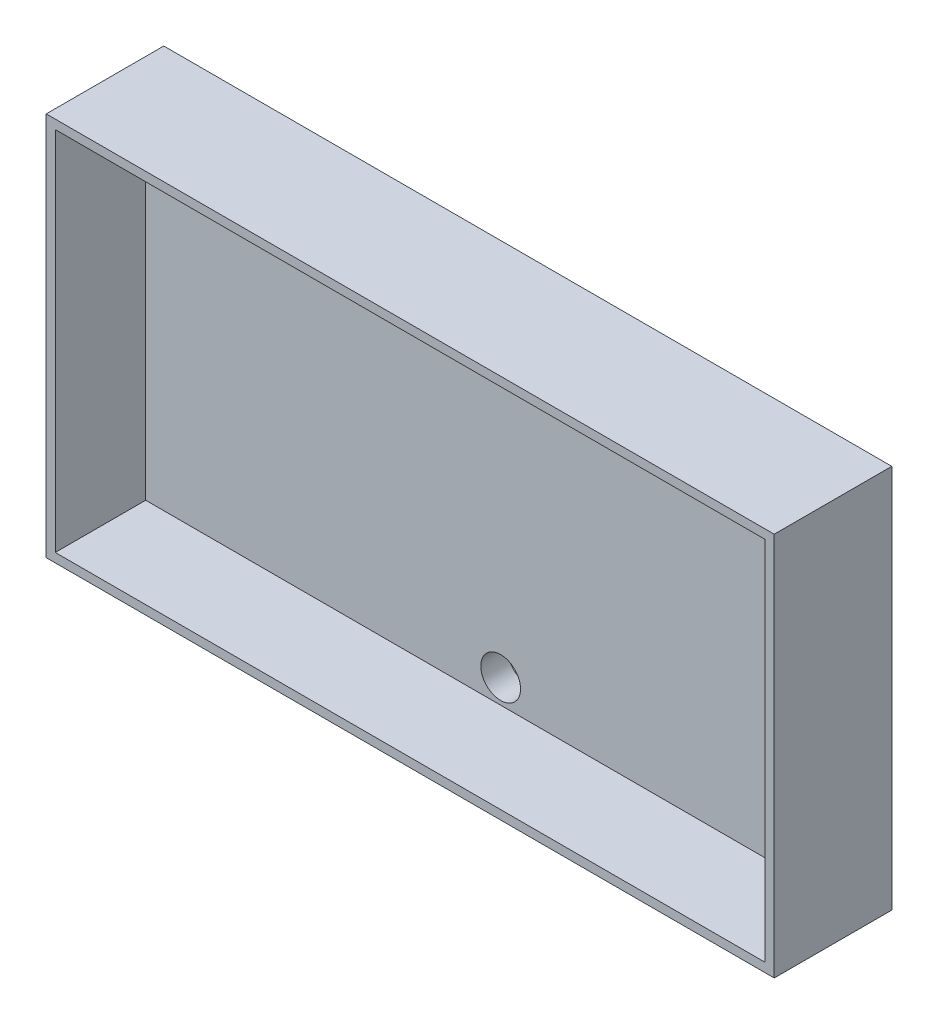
ISO-10303-21;
HEADER;
FILE_DESCRIPTION(('STEP AP214'),'2;1');
FILE_NAME('part.step','',(''),(''),'','','');
FILE_SCHEMA(('AUTOMOTIVE_DESIGN { 1 0 10303 214 1 1 1 1 }'));
ENDSEC;
DATA;
#1=APPLICATION_CONTEXT('core data for automotive mechanical design processes');
#2=APPLICATION_PROTOCOL_DEFINITION('international standard','automotive_design',2000,#1);
#3=PRODUCT_CONTEXT('',#1,'mechanical');
#4=PRODUCT('Part','Part','',(#3));
#5=PRODUCT_RELATED_PRODUCT_CATEGORY('part','',(#4));
#6=PRODUCT_DEFINITION_FORMATION('','',#4);
#7=PRODUCT_DEFINITION_CONTEXT('part definition',#1,'design');
#8=PRODUCT_DEFINITION('design','',#6,#7);
#9=PRODUCT_DEFINITION_SHAPE('','',#8);
#10=(LENGTH_UNIT() NAMED_UNIT(*) SI_UNIT(.MILLI.,.METRE.));
#11=(NAMED_UNIT(*) PLANE_ANGLE_UNIT() SI_UNIT($,.RADIAN.));
#12=(NAMED_UNIT(*) SI_UNIT($,.STERADIAN.) SOLID_ANGLE_UNIT());
#13=UNCERTAINTY_MEASURE_WITH_UNIT(LENGTH_MEASURE(1.E-05),#10,'distance_accuracy_value','');
#14=(GEOMETRIC_REPRESENTATION_CONTEXT(3) GLOBAL_UNCERTAINTY_ASSIGNED_CONTEXT((#13)) GLOBAL_UNIT_ASSIGNED_CONTEXT((#10,
#11,#12)) REPRESENTATION_CONTEXT('',''));
#15=CARTESIAN_POINT('',(0.,0.,0.));
#16=DIRECTION('',(0.,0.,1.));
#17=DIRECTION('',(1.,0.,0.));
#18=AXIS2_PLACEMENT_3D('',#15,#16,#17);
#19=CARTESIAN_POINT('',(0.,0.,10.));
#20=DIRECTION('',(0.,0.,1.));
#21=DIRECTION('',(1.,0.,0.));
#22=AXIS2_PLACEMENT_3D('',#19,#20,#21);
#23=PLANE('',#22);
#24=DIRECTION('',(0.,-1.,0.));
#25=VECTOR('',#24,1.);
#26=CARTESIAN_POINT('',(-40.25,20.2500000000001,10.));
#27=LINE('',#26,#25);
#28=CARTESIAN_POINT('',(-40.25,21.2500000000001,10.));
#29=VERTEX_POINT('',#28);
#30=CARTESIAN_POINT('',(-40.25,-21.2499999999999,10.));
#31=VERTEX_POINT('',#30);
#32=EDGE_CURVE('E178',#29,#31,#27,.T.);
#33=ORIENTED_EDGE('',*,*,#32,.T.);
#34=DIRECTION('',(1.,0.,0.));
#35=VECTOR('',#34,1.);
#36=CARTESIAN_POINT('',(-39.25,-21.2499999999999,10.));
#37=LINE('',#36,#35);
#38=CARTESIAN_POINT('',(40.25,-21.2499999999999,10.));
#39=VERTEX_POINT('',#38);
#40=EDGE_CURVE('E125',#31,#39,#37,.T.);
#41=ORIENTED_EDGE('',*,*,#40,.T.);
#42=DIRECTION('',(0.,1.,0.));
#43=VECTOR('',#42,1.);
#44=CARTESIAN_POINT('',(40.25,20.2500000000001,10.));
#45=LINE('',#44,#43);
#46=CARTESIAN_POINT('',(40.25,21.2500000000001,10.));
#47=VERTEX_POINT('',#46);
#48=EDGE_CURVE('E181',#39,#47,#45,.T.);
#49=ORIENTED_EDGE('',*,*,#48,.T.);
#50=DIRECTION('',(-1.,0.,0.));
#51=VECTOR('',#50,1.);
#52=CARTESIAN_POINT('',(-39.25,21.2500000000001,10.));
#53=LINE('',#52,#51);
#54=EDGE_CURVE('E79',#47,#29,#53,.T.);
#55=ORIENTED_EDGE('',*,*,#54,.T.);
#56=EDGE_LOOP('',(#33,#41,#49,#55));
#57=FACE_BOUND('',#56,.T.);
#58=DIRECTION('',(1.,0.,0.));
#59=VECTOR('',#58,1.);
#60=CARTESIAN_POINT('',(-39.25,-20.2499999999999,10.));
#61=LINE('',#60,#59);
#62=CARTESIAN_POINT('',(-39.25,-20.2499999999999,10.));
#63=VERTEX_POINT('',#62);
#64=CARTESIAN_POINT('',(39.25,-20.2499999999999,10.));
#65=VERTEX_POINT('',#64);
#66=EDGE_CURVE('E153',#63,#65,#61,.T.);
#67=ORIENTED_EDGE('',*,*,#66,.F.);
#68=DIRECTION('',(0.,-1.,0.));
#69=VECTOR('',#68,1.);
#70=CARTESIAN_POINT('',(-39.25,20.2500000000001,10.));
#71=LINE('',#70,#69);
#72=CARTESIAN_POINT('',(-39.25,20.2500000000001,10.));
#73=VERTEX_POINT('',#72);
#74=EDGE_CURVE('E151',#73,#63,#71,.T.);
#75=ORIENTED_EDGE('',*,*,#74,.F.);
#76=DIRECTION('',(-1.,0.,0.));
#77=VECTOR('',#76,1.);
#78=CARTESIAN_POINT('',(-39.25,20.2500000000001,10.));
#79=LINE('',#78,#77);
#80=CARTESIAN_POINT('',(39.25,20.2500000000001,10.));
#81=VERTEX_POINT('',#80);
#82=EDGE_CURVE('E158',#81,#73,#79,.T.);
#83=ORIENTED_EDGE('',*,*,#82,.F.);
#84=DIRECTION('',(0.,1.,0.));
#85=VECTOR('',#84,1.);
#86=CARTESIAN_POINT('',(39.25,20.2500000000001,10.));
#87=LINE('',#86,#85);
#88=EDGE_CURVE('E156',#65,#81,#87,.T.);
#89=ORIENTED_EDGE('',*,*,#88,.F.);
#90=EDGE_LOOP('',(#67,#75,#83,#89));
#91=FACE_BOUND('',#90,.T.);
#92=ADVANCED_FACE('F56',(#57,#91),#23,.T.);
#93=CARTESIAN_POINT('',(-40.25,20.2500000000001,10.));
#94=DIRECTION('',(1.,0.,0.));
#95=DIRECTION('',(0.,0.,-1.));
#96=AXIS2_PLACEMENT_3D('',#93,#94,#95);
#97=PLANE('',#96);
#98=DIRECTION('',(0.,0.,-1.));
#99=VECTOR('',#98,1.);
#100=CARTESIAN_POINT('',(-40.25,21.2500000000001,10.));
#101=LINE('',#100,#99);
#102=CARTESIAN_POINT('',(-40.25,21.2500000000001,-3.));
#103=VERTEX_POINT('',#102);
#104=EDGE_CURVE('E139',#29,#103,#101,.T.);
#105=ORIENTED_EDGE('',*,*,#104,.T.);
#106=DIRECTION('',(0.,-1.,0.));
#107=VECTOR('',#106,1.);
#108=CARTESIAN_POINT('',(-40.25,21.2500000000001,-3.));
#109=LINE('',#108,#107);
#110=CARTESIAN_POINT('',(-40.25,-21.2499999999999,-3.));
#111=VERTEX_POINT('',#110);
#112=EDGE_CURVE('E134',#103,#111,#109,.T.);
#113=ORIENTED_EDGE('',*,*,#112,.T.);
#114=DIRECTION('',(0.,0.,-1.));
#115=VECTOR('',#114,1.);
#116=CARTESIAN_POINT('',(-40.25,-21.2499999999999,10.));
#117=LINE('',#116,#115);
#118=EDGE_CURVE('E12',#31,#111,#117,.T.);
#119=ORIENTED_EDGE('',*,*,#118,.F.);
#120=ORIENTED_EDGE('',*,*,#32,.F.);
#121=EDGE_LOOP('',(#105,#113,#119,#120));
#122=FACE_BOUND('',#121,.T.);
#123=ADVANCED_FACE('F58',(#122),#97,.F.);
#124=CARTESIAN_POINT('',(-39.25,-21.2499999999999,10.));
#125=DIRECTION('',(0.,1.,0.));
#126=DIRECTION('',(0.,0.,1.));
#127=AXIS2_PLACEMENT_3D('',#124,#125,#126);
#128=PLANE('',#127);
#129=ORIENTED_EDGE('',*,*,#118,.T.);
#130=DIRECTION('',(1.,0.,0.));
#131=VECTOR('',#130,1.);
#132=CARTESIAN_POINT('',(-40.25,-21.2499999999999,-3.));
#133=LINE('',#132,#131);
#134=CARTESIAN_POINT('',(40.25,-21.2499999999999,-3.));
#135=VERTEX_POINT('',#134);
#136=EDGE_CURVE('E124',#111,#135,#133,.T.);
#137=ORIENTED_EDGE('',*,*,#136,.T.);
#138=DIRECTION('',(0.,0.,-1.));
#139=VECTOR('',#138,1.);
#140=CARTESIAN_POINT('',(40.25,-21.2499999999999,10.));
#141=LINE('',#140,#139);
#142=EDGE_CURVE('E64',#39,#135,#141,.T.);
#143=ORIENTED_EDGE('',*,*,#142,.F.);
#144=ORIENTED_EDGE('',*,*,#40,.F.);
#145=EDGE_LOOP('',(#129,#137,#143,#144));
#146=FACE_BOUND('',#145,.T.);
#147=ADVANCED_FACE('F122',(#146),#128,.F.);
#148=CARTESIAN_POINT('',(40.25,20.2500000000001,10.));
#149=DIRECTION('',(-1.,0.,0.));
#150=DIRECTION('',(0.,0.,1.));
#151=AXIS2_PLACEMENT_3D('',#148,#149,#150);
#152=PLANE('',#151);
#153=ORIENTED_EDGE('',*,*,#142,.T.);
#154=DIRECTION('',(0.,1.,0.));
#155=VECTOR('',#154,1.);
#156=CARTESIAN_POINT('',(40.25,-21.2499999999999,-3.));
#157=LINE('',#156,#155);
#158=CARTESIAN_POINT('',(40.25,21.2500000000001,-3.));
#159=VERTEX_POINT('',#158);
#160=EDGE_CURVE('E137',#135,#159,#157,.T.);
#161=ORIENTED_EDGE('',*,*,#160,.T.);
#162=DIRECTION('',(0.,0.,-1.));
#163=VECTOR('',#162,1.);
#164=CARTESIAN_POINT('',(40.25,21.2500000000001,10.));
#165=LINE('',#164,#163);
#166=EDGE_CURVE('E185',#47,#159,#165,.T.);
#167=ORIENTED_EDGE('',*,*,#166,.F.);
#168=ORIENTED_EDGE('',*,*,#48,.F.);
#169=EDGE_LOOP('',(#153,#161,#167,#168));
#170=FACE_BOUND('',#169,.T.);
#171=ADVANCED_FACE('F188',(#170),#152,.F.);
#172=CARTESIAN_POINT('',(-39.25,21.2500000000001,10.));
#173=DIRECTION('',(0.,-1.,0.));
#174=DIRECTION('',(0.,0.,-1.));
#175=AXIS2_PLACEMENT_3D('',#172,#173,#174);
#176=PLANE('',#175);
#177=ORIENTED_EDGE('',*,*,#166,.T.);
#178=DIRECTION('',(-1.,0.,0.));
#179=VECTOR('',#178,1.);
#180=CARTESIAN_POINT('',(40.25,21.2500000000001,-3.));
#181=LINE('',#180,#179);
#182=EDGE_CURVE('E148',#159,#103,#181,.T.);
#183=ORIENTED_EDGE('',*,*,#182,.T.);
#184=ORIENTED_EDGE('',*,*,#104,.F.);
#185=ORIENTED_EDGE('',*,*,#54,.F.);
#186=EDGE_LOOP('',(#177,#183,#184,#185));
#187=FACE_BOUND('',#186,.T.);
#188=ADVANCED_FACE('F225',(#187),#176,.F.);
#189=CARTESIAN_POINT('',(-39.25,20.2500000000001,10.));
#190=DIRECTION('',(1.,0.,0.));
#191=DIRECTION('',(0.,0.,-1.));
#192=AXIS2_PLACEMENT_3D('',#189,#190,#191);
#193=PLANE('',#192);
#194=DIRECTION('',(0.,-1.,0.));
#195=VECTOR('',#194,1.);
#196=CARTESIAN_POINT('',(-39.25,20.2500000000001,0.));
#197=LINE('',#196,#195);
#198=CARTESIAN_POINT('',(-39.25,20.2500000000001,0.));
#199=VERTEX_POINT('',#198);
#200=CARTESIAN_POINT('',(-39.25,-20.2499999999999,0.));
#201=VERTEX_POINT('',#200);
#202=EDGE_CURVE('E150',#199,#201,#197,.T.);
#203=ORIENTED_EDGE('',*,*,#202,.F.);
#204=DIRECTION('',(0.,0.,-1.));
#205=VECTOR('',#204,1.);
#206=CARTESIAN_POINT('',(-39.25,20.2500000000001,10.));
#207=LINE('',#206,#205);
#208=EDGE_CURVE('E160',#73,#199,#207,.T.);
#209=ORIENTED_EDGE('',*,*,#208,.F.);
#210=ORIENTED_EDGE('',*,*,#74,.T.);
#211=DIRECTION('',(0.,0.,-1.));
#212=VECTOR('',#211,1.);
#213=CARTESIAN_POINT('',(-39.25,-20.2499999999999,10.));
#214=LINE('',#213,#212);
#215=EDGE_CURVE('E175',#63,#201,#214,.T.);
#216=ORIENTED_EDGE('',*,*,#215,.T.);
#217=EDGE_LOOP('',(#203,#209,#210,#216));
#218=FACE_BOUND('',#217,.T.);
#219=ADVANCED_FACE('F208',(#218),#193,.T.);
#220=CARTESIAN_POINT('',(-39.25,-20.2499999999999,10.));
#221=DIRECTION('',(0.,1.,0.));
#222=DIRECTION('',(0.,0.,1.));
#223=AXIS2_PLACEMENT_3D('',#220,#221,#222);
#224=PLANE('',#223);
#225=DIRECTION('',(1.,0.,0.));
#226=VECTOR('',#225,1.);
#227=CARTESIAN_POINT('',(-39.25,-20.2499999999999,0.));
#228=LINE('',#227,#226);
#229=CARTESIAN_POINT('',(39.25,-20.2499999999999,0.));
#230=VERTEX_POINT('',#229);
#231=EDGE_CURVE('E163',#201,#230,#228,.T.);
#232=ORIENTED_EDGE('',*,*,#231,.F.);
#233=ORIENTED_EDGE('',*,*,#215,.F.);
#234=ORIENTED_EDGE('',*,*,#66,.T.);
#235=DIRECTION('',(0.,0.,-1.));
#236=VECTOR('',#235,1.);
#237=CARTESIAN_POINT('',(39.25,-20.2499999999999,10.));
#238=LINE('',#237,#236);
#239=EDGE_CURVE('E173',#65,#230,#238,.T.);
#240=ORIENTED_EDGE('',*,*,#239,.T.);
#241=EDGE_LOOP('',(#232,#233,#234,#240));
#242=FACE_BOUND('',#241,.T.);
#243=ADVANCED_FACE('F200',(#242),#224,.T.);
#244=CARTESIAN_POINT('',(39.25,20.2500000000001,10.));
#245=DIRECTION('',(-1.,0.,0.));
#246=DIRECTION('',(0.,0.,1.));
#247=AXIS2_PLACEMENT_3D('',#244,#245,#246);
#248=PLANE('',#247);
#249=DIRECTION('',(0.,1.,0.));
#250=VECTOR('',#249,1.);
#251=CARTESIAN_POINT('',(39.25,20.2500000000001,0.));
#252=LINE('',#251,#250);
#253=CARTESIAN_POINT('',(39.25,20.2500000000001,0.));
#254=VERTEX_POINT('',#253);
#255=EDGE_CURVE('E166',#230,#254,#252,.T.);
#256=ORIENTED_EDGE('',*,*,#255,.F.);
#257=ORIENTED_EDGE('',*,*,#239,.F.);
#258=ORIENTED_EDGE('',*,*,#88,.T.);
#259=DIRECTION('',(0.,0.,-1.));
#260=VECTOR('',#259,1.);
#261=CARTESIAN_POINT('',(39.25,20.2500000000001,10.));
#262=LINE('',#261,#260);
#263=EDGE_CURVE('E71',#81,#254,#262,.T.);
#264=ORIENTED_EDGE('',*,*,#263,.T.);
#265=EDGE_LOOP('',(#256,#257,#258,#264));
#266=FACE_BOUND('',#265,.T.);
#267=ADVANCED_FACE('F203',(#266),#248,.T.);
#268=CARTESIAN_POINT('',(-39.25,20.2500000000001,10.));
#269=DIRECTION('',(0.,-1.,0.));
#270=DIRECTION('',(0.,0.,-1.));
#271=AXIS2_PLACEMENT_3D('',#268,#269,#270);
#272=PLANE('',#271);
#273=DIRECTION('',(-1.,0.,0.));
#274=VECTOR('',#273,1.);
#275=CARTESIAN_POINT('',(-39.25,20.2500000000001,0.));
#276=LINE('',#275,#274);
#277=EDGE_CURVE('E154',#254,#199,#276,.T.);
#278=ORIENTED_EDGE('',*,*,#277,.F.);
#279=ORIENTED_EDGE('',*,*,#263,.F.);
#280=ORIENTED_EDGE('',*,*,#82,.T.);
#281=ORIENTED_EDGE('',*,*,#208,.T.);
#282=EDGE_LOOP('',(#278,#279,#280,#281));
#283=FACE_BOUND('',#282,.T.);
#284=ADVANCED_FACE('F210',(#283),#272,.T.);
#285=CARTESIAN_POINT('',(0.,0.,0.));
#286=DIRECTION('',(0.,0.,1.));
#287=DIRECTION('',(1.,0.,0.));
#288=AXIS2_PLACEMENT_3D('',#285,#286,#287);
#289=PLANE('',#288);
#290=CARTESIAN_POINT('',(0.,-17.6,0.));
#291=DIRECTION('',(0.,0.,1.));
#292=DIRECTION('',(1.,0.,0.));
#293=AXIS2_PLACEMENT_3D('',#290,#291,#292);
#294=CIRCLE('',#293,2.2);
#295=CARTESIAN_POINT('',(2.2,-17.6,0.));
#296=VERTEX_POINT('',#295);
#297=EDGE_CURVE('E140',#296,#296,#294,.T.);
#298=ORIENTED_EDGE('',*,*,#297,.F.);
#299=EDGE_LOOP('',(#298));
#300=FACE_BOUND('',#299,.T.);
#301=CARTESIAN_POINT('',(0.,17.6,0.));
#302=DIRECTION('',(0.,0.,1.));
#303=DIRECTION('',(1.,0.,0.));
#304=AXIS2_PLACEMENT_3D('',#301,#302,#303);
#305=CIRCLE('',#304,2.2);
#306=CARTESIAN_POINT('',(2.2,17.6,0.));
#307=VERTEX_POINT('',#306);
#308=EDGE_CURVE('E143',#307,#307,#305,.T.);
#309=ORIENTED_EDGE('',*,*,#308,.F.);
#310=EDGE_LOOP('',(#309));
#311=FACE_BOUND('',#310,.T.);
#312=ORIENTED_EDGE('',*,*,#277,.T.);
#313=ORIENTED_EDGE('',*,*,#202,.T.);
#314=ORIENTED_EDGE('',*,*,#231,.T.);
#315=ORIENTED_EDGE('',*,*,#255,.T.);
#316=EDGE_LOOP('',(#312,#313,#314,#315));
#317=FACE_BOUND('',#316,.T.);
#318=ADVANCED_FACE('F205',(#300,#311,#317),#289,.T.);
#319=CARTESIAN_POINT('',(0.,0.,-3.));
#320=DIRECTION('',(0.,0.,1.));
#321=DIRECTION('',(1.,0.,0.));
#322=AXIS2_PLACEMENT_3D('',#319,#320,#321);
#323=PLANE('',#322);
#324=CARTESIAN_POINT('',(0.,-17.6,-3.));
#325=DIRECTION('',(0.,0.,1.));
#326=DIRECTION('',(1.,0.,0.));
#327=AXIS2_PLACEMENT_3D('',#324,#325,#326);
#328=CIRCLE('',#327,2.2);
#329=CARTESIAN_POINT('',(2.2,-17.6,-3.));
#330=VERTEX_POINT('',#329);
#331=EDGE_CURVE('E327',#330,#330,#328,.T.);
#332=ORIENTED_EDGE('',*,*,#331,.T.);
#333=EDGE_LOOP('',(#332));
#334=FACE_BOUND('',#333,.T.);
#335=CARTESIAN_POINT('',(0.,17.6,-3.));
#336=DIRECTION('',(0.,0.,1.));
#337=DIRECTION('',(1.,0.,0.));
#338=AXIS2_PLACEMENT_3D('',#335,#336,#337);
#339=CIRCLE('',#338,2.2);
#340=CARTESIAN_POINT('',(2.2,17.6,-3.));
#341=VERTEX_POINT('',#340);
#342=EDGE_CURVE('E328',#341,#341,#339,.T.);
#343=ORIENTED_EDGE('',*,*,#342,.T.);
#344=EDGE_LOOP('',(#343));
#345=FACE_BOUND('',#344,.T.);
#346=ORIENTED_EDGE('',*,*,#112,.F.);
#347=ORIENTED_EDGE('',*,*,#182,.F.);
#348=ORIENTED_EDGE('',*,*,#160,.F.);
#349=ORIENTED_EDGE('',*,*,#136,.F.);
#350=EDGE_LOOP('',(#346,#347,#348,#349));
#351=FACE_BOUND('',#350,.T.);
#352=ADVANCED_FACE('F132',(#334,#345,#351),#323,.F.);
#353=CARTESIAN_POINT('',(0.,17.6,-3.));
#354=DIRECTION('',(0.,0.,1.));
#355=DIRECTION('',(1.,0.,0.));
#356=AXIS2_PLACEMENT_3D('',#353,#354,#355);
#357=CYLINDRICAL_SURFACE('',#356,2.2);
#358=ORIENTED_EDGE('',*,*,#308,.T.);
#359=EDGE_LOOP('',(#358));
#360=FACE_BOUND('',#359,.T.);
#361=ORIENTED_EDGE('',*,*,#342,.F.);
#362=EDGE_LOOP('',(#361));
#363=FACE_BOUND('',#362,.T.);
#364=ADVANCED_FACE('F300',(#360,#363),#357,.F.);
#365=CARTESIAN_POINT('',(0.,-17.6,-3.));
#366=DIRECTION('',(0.,0.,1.));
#367=DIRECTION('',(1.,0.,0.));
#368=AXIS2_PLACEMENT_3D('',#365,#366,#367);
#369=CYLINDRICAL_SURFACE('',#368,2.2);
#370=ORIENTED_EDGE('',*,*,#297,.T.);
#371=EDGE_LOOP('',(#370));
#372=FACE_BOUND('',#371,.T.);
#373=ORIENTED_EDGE('',*,*,#331,.F.);
#374=EDGE_LOOP('',(#373));
#375=FACE_BOUND('',#374,.T.);
#376=ADVANCED_FACE('F309',(#372,#375),#369,.F.);
#377=CLOSED_SHELL('',(#92,#123,#147,#171,#188,#219,#243,#267,#284,#318,#352,#364,#376));
#378=MANIFOLD_SOLID_BREP('B2',#377);
#379=ADVANCED_BREP_SHAPE_REPRESENTATION('',(#18,#378),#14);
#380=SHAPE_DEFINITION_REPRESENTATION(#9,#379);
ENDSEC;
END-ISO-10303-21;
